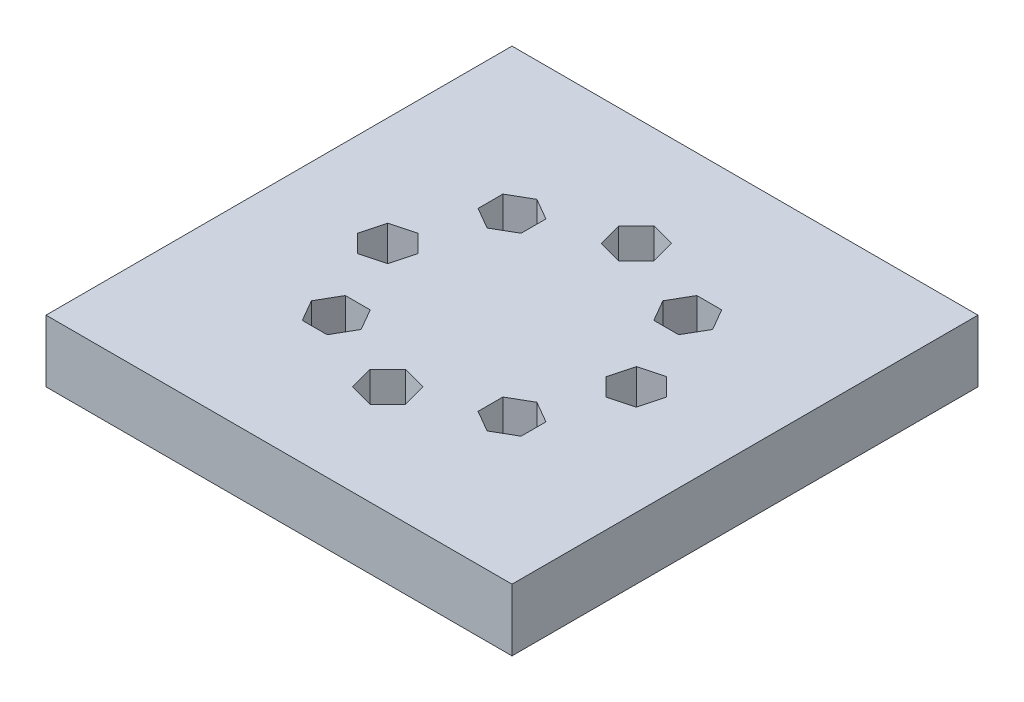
from build123d import *

# Parameters (mm, degrees)
SKETCH2_W          = 150
SKETCH2_H          = 150
EXTRUDE1_DEPTH     = 20
CUT_EXTRUDE1_DEPTH = 108.935165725
CIRPATTERN1_COUNT  = 8


with BuildPart() as part:
    # Sketch2 → Extrude1 (new body)
    with BuildSketch(Plane(origin=(0, 0, 0), x_dir=(1, 0, 0), z_dir=(0, 1, 0))):
        Rectangle(SKETCH2_W, SKETCH2_H)
    extrude(amount=EXTRUDE1_DEPTH)

    # Sketch3 → Cut-Extrude1 (cut, through all)
    with BuildSketch(Plane(origin=(0, 20, 0), x_dir=(1, 0, 0), z_dir=(0, 1, 0))):
        Polygon((36.284271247, 28.284271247), (32.284271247, 35.212474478), (24.284271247, 35.212474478), (20.284271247, 28.284271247), (24.284271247, 21.356068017), (32.284271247, 21.356068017), align=None)
    cut_extrude1 = extrude(amount=-CUT_EXTRUDE1_DEPTH, mode=Mode.SUBTRACT)

    # CirPattern1: Cut-Extrude1 ×8 about axis
    cirpattern1_axis = Axis((0, 0, 0), (0, 1, 0))
    for i in range(1, CIRPATTERN1_COUNT):
        add(cut_extrude1.rotate(cirpattern1_axis, i * 360 / CIRPATTERN1_COUNT), mode=Mode.SUBTRACT)


solid = part.part
